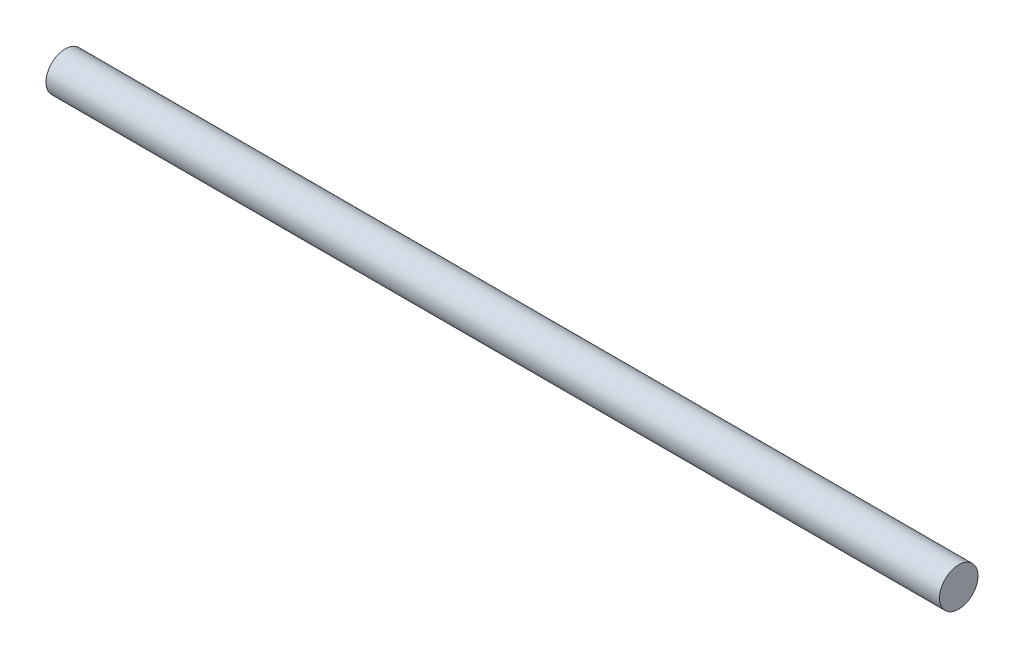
ISO-10303-21;
HEADER;
FILE_DESCRIPTION(('STEP AP214'),'2;1');
FILE_NAME('part.step','',(''),(''),'','','');
FILE_SCHEMA(('AUTOMOTIVE_DESIGN { 1 0 10303 214 1 1 1 1 }'));
ENDSEC;
DATA;
#1=APPLICATION_CONTEXT('core data for automotive mechanical design processes');
#2=APPLICATION_PROTOCOL_DEFINITION('international standard','automotive_design',2000,#1);
#3=PRODUCT_CONTEXT('',#1,'mechanical');
#4=PRODUCT('Part','Part','',(#3));
#5=PRODUCT_RELATED_PRODUCT_CATEGORY('part','',(#4));
#6=PRODUCT_DEFINITION_FORMATION('','',#4);
#7=PRODUCT_DEFINITION_CONTEXT('part definition',#1,'design');
#8=PRODUCT_DEFINITION('design','',#6,#7);
#9=PRODUCT_DEFINITION_SHAPE('','',#8);
#10=(LENGTH_UNIT() NAMED_UNIT(*) SI_UNIT(.MILLI.,.METRE.));
#11=(NAMED_UNIT(*) PLANE_ANGLE_UNIT() SI_UNIT($,.RADIAN.));
#12=(NAMED_UNIT(*) SI_UNIT($,.STERADIAN.) SOLID_ANGLE_UNIT());
#13=UNCERTAINTY_MEASURE_WITH_UNIT(LENGTH_MEASURE(1.E-05),#10,'distance_accuracy_value','');
#14=(GEOMETRIC_REPRESENTATION_CONTEXT(3) GLOBAL_UNCERTAINTY_ASSIGNED_CONTEXT((#13)) GLOBAL_UNIT_ASSIGNED_CONTEXT((#10,
#11,#12)) REPRESENTATION_CONTEXT('',''));
#15=CARTESIAN_POINT('',(0.,0.,0.));
#16=DIRECTION('',(0.,0.,1.));
#17=DIRECTION('',(1.,0.,0.));
#18=AXIS2_PLACEMENT_3D('',#15,#16,#17);
#19=CARTESIAN_POINT('',(185.672,0.,0.));
#20=DIRECTION('',(-1.,0.,0.));
#21=DIRECTION('',(0.,0.,1.));
#22=AXIS2_PLACEMENT_3D('',#19,#20,#21);
#23=CYLINDRICAL_SURFACE('',#22,4.);
#24=CARTESIAN_POINT('',(185.672,0.,0.));
#25=DIRECTION('',(1.,0.,0.));
#26=DIRECTION('',(0.,0.,-1.));
#27=AXIS2_PLACEMENT_3D('',#24,#25,#26);
#28=CIRCLE('',#27,4.);
#29=CARTESIAN_POINT('',(185.672,0.,-4.));
#30=VERTEX_POINT('',#29);
#31=EDGE_CURVE('E10',#30,#30,#28,.T.);
#32=ORIENTED_EDGE('',*,*,#31,.F.);
#33=EDGE_LOOP('',(#32));
#34=FACE_BOUND('',#33,.T.);
#35=CARTESIAN_POINT('',(0.,0.,0.));
#36=DIRECTION('',(1.,0.,0.));
#37=DIRECTION('',(0.,0.,-1.));
#38=AXIS2_PLACEMENT_3D('',#35,#36,#37);
#39=CIRCLE('',#38,4.);
#40=CARTESIAN_POINT('',(0.,0.,-4.));
#41=VERTEX_POINT('',#40);
#42=EDGE_CURVE('E41',#41,#41,#39,.T.);
#43=ORIENTED_EDGE('',*,*,#42,.T.);
#44=EDGE_LOOP('',(#43));
#45=FACE_BOUND('',#44,.T.);
#46=ADVANCED_FACE('F38',(#34,#45),#23,.T.);
#47=CARTESIAN_POINT('',(185.672,0.,0.));
#48=DIRECTION('',(1.,0.,0.));
#49=DIRECTION('',(0.,0.,-1.));
#50=AXIS2_PLACEMENT_3D('',#47,#48,#49);
#51=PLANE('',#50);
#52=ORIENTED_EDGE('',*,*,#31,.T.);
#53=EDGE_LOOP('',(#52));
#54=FACE_BOUND('',#53,.T.);
#55=ADVANCED_FACE('F53',(#54),#51,.T.);
#56=CARTESIAN_POINT('',(0.,0.,0.));
#57=DIRECTION('',(1.,0.,0.));
#58=DIRECTION('',(0.,0.,-1.));
#59=AXIS2_PLACEMENT_3D('',#56,#57,#58);
#60=PLANE('',#59);
#61=ORIENTED_EDGE('',*,*,#42,.F.);
#62=EDGE_LOOP('',(#61));
#63=FACE_BOUND('',#62,.T.);
#64=ADVANCED_FACE('F51',(#63),#60,.F.);
#65=CLOSED_SHELL('',(#46,#55,#64));
#66=MANIFOLD_SOLID_BREP('B2',#65);
#67=ADVANCED_BREP_SHAPE_REPRESENTATION('',(#18,#66),#14);
#68=SHAPE_DEFINITION_REPRESENTATION(#9,#67);
ENDSEC;
END-ISO-10303-21;
